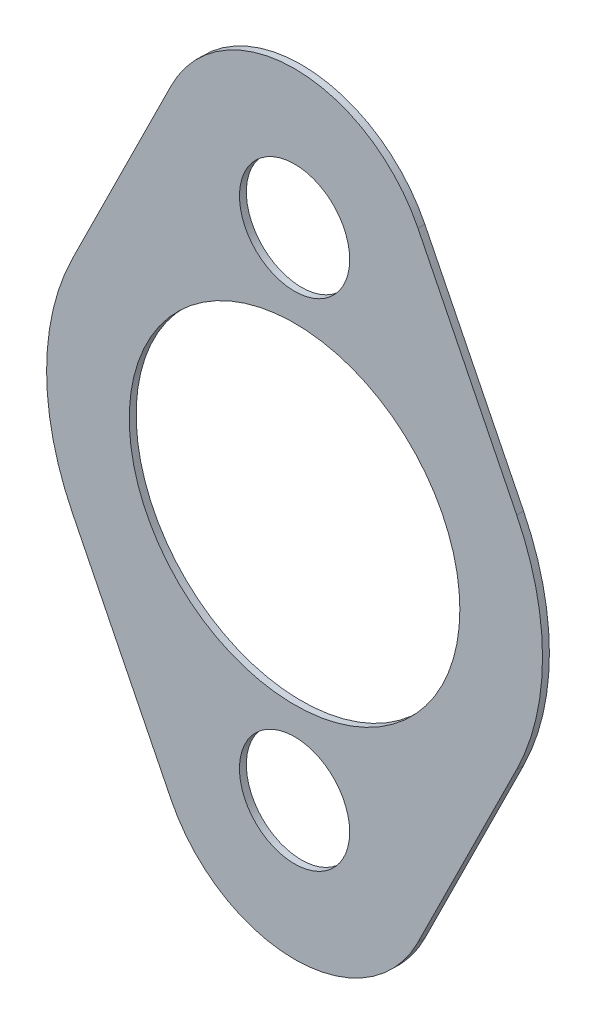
from build123d import *

# Parameters (mm, degrees)
MAIN_DEPTH  = 1.5875
SKETCH2_R   = 12.7
SKETCH2_R_2 = 38.1
HOLES_DEPTH = 106.696985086


with BuildPart() as part:
    # Sketch1 → Main (new body)
    with BuildSketch(Plane.XY):
        with BuildLine():
            Line((28.441853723, 71.261111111), (51.195336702, 25.4))
            ThreePointArc((51.195336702, 25.4), (57.15, 0), (51.195336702, -25.4))
            Line((51.195336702, -25.4), (28.441853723, -71.261111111))
            ThreePointArc((28.441853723, -71.261111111), (0, -88.9), (-28.441853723, -71.261111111))
            Line((-28.441853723, -71.261111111), (-51.195336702, -25.4))
            ThreePointArc((-51.195336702, -25.4), (-57.15, 0), (-51.195336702, 25.4))
            Line((-51.195336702, 25.4), (-28.441853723, 71.261111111))
            ThreePointArc((-28.441853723, 71.261111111), (0, 88.9), (28.441853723, 71.261111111))
        make_face()
    extrude(amount=MAIN_DEPTH)

    # Sketch2 → Holes (cut, through all)
    with BuildSketch(Plane.XY.offset(1.5875)):
        with Locations((0, 57.15)):
            Circle(SKETCH2_R)
        with Locations((0, -57.15)):
            Circle(SKETCH2_R)
        Circle(SKETCH2_R_2)
    extrude(amount=-HOLES_DEPTH, mode=Mode.SUBTRACT)


solid = part.part
